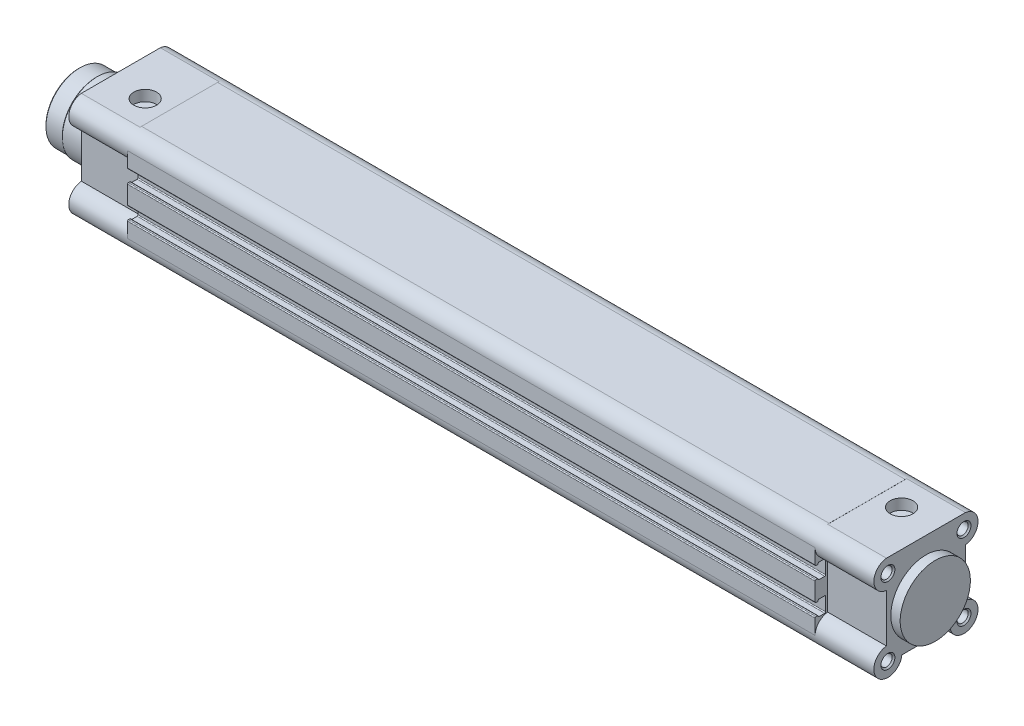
from build123d import *

# Parameters (mm, degrees)
BASIS_LINEAR_AUSTRAGEN_DEPTH         = 25.1
AUFSATZ_LINEAR_AUSTRAGEN1_DEPTH      = 293.8
AUFSATZ_LINEAR_AUSTRAGEN2_DEPTH      = 25.1
SKIZZE4_R                            = 15
AUFSATZ_LINEAR_AUSTRAGEN3_DEPTH      = 4
SCHNITT_LINEAR_AUSTRAGEN1_DEPTH      = 5
SCHNITT_LINEAR_AUSTRAGEN1_DEPTH_BACK = 5
SKIZZE8_W                            = 4.864
SKIZZE8_H                            = 4.864
SKIZZE9_W                            = 4.864
SKIZZE9_H                            = 4.864
SCHNITT_LINEAR_START                 = -30
SKIZZE18_R                           = 14
SCHNITT_LINEAR_AUSTRAGEN2_DEPTH      = 30
SKIZZE19_R                           = 6
SCHNITT_LINEAR_AUSTRAGEN3_DEPTH      = 100


with BuildPart() as part:
    # Skizze1 → Basis-Linear austragen (new body)
    with BuildSketch(Plane(origin=(0, 0, 0), x_dir=(0, 0, -1), z_dir=(1, 0, 0))):
        with BuildLine():
            Line((-16.875, 10.282640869), (-16.875, -10.282640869))
            ThreePointArc((-16.875, -10.282640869), (-20.496194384, -20.489084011), (-10.283696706, -16.885))
            Line((-10.283696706, -16.885), (10.283696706, -16.885))
            ThreePointArc((10.283696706, -16.885), (20.496194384, -20.489084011), (16.875, -10.282640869))
            Line((16.875, -10.282640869), (16.875, 10.282640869))
            ThreePointArc((16.875, 10.282640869), (22.25, 16.25), (16.875, 22.217359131))
            Line((16.875, 22.217359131), (-16.875, 22.217359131))
            ThreePointArc((-16.875, 22.217359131), (-22.25, 16.25), (-16.875, 10.282640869))
        make_face()
    extrude(amount=BASIS_LINEAR_AUSTRAGEN_DEPTH)

    # Skizze2 → Aufsatz-Linear austragen1 (add)
    with BuildSketch(Plane(origin=(25.1, 0, 0), x_dir=(0, 0, -1), z_dir=(1, 0, 0))):
        with BuildLine():
            Line((-22.25, 3.85), (-22.25, -3.85))
            ThreePointArc((-22.25, -3.85), (-22.132842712, -4.132842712), (-21.85, -4.25))
            Line((-21.85, -4.25), (-21.25, -4.25))
            ThreePointArc((-21.25, -4.25), (-21.037867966, -4.162132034), (-20.95, -3.95))
            Line((-20.95, -3.95), (-20.95, -3.9))
            ThreePointArc((-20.95, -3.9), (-20.862132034, -3.687867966), (-20.65, -3.6))
            Line((-20.65, -3.6), (-18.15, -3.6))
            ThreePointArc((-18.15, -3.6), (-17.867157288, -3.717157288), (-17.75, -4))
            Line((-17.75, -4), (-17.75, -9.7))
            ThreePointArc((-17.75, -9.7), (-17.867157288, -9.982842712), (-18.15, -10.1))
            Line((-18.15, -10.1), (-20.65, -10.1))
            ThreePointArc((-20.65, -10.1), (-20.862132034, -10.012132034), (-20.95, -9.8))
            Line((-20.95, -9.8), (-20.95, -9.75))
            ThreePointArc((-20.95, -9.75), (-21.037867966, -9.537867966), (-21.25, -9.45))
            Line((-21.25, -9.45), (-21.85, -9.45))
            ThreePointArc((-21.85, -9.45), (-22.132842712, -9.567157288), (-22.25, -9.85))
            Line((-22.25, -9.85), (-22.25, -16.25))
            ThreePointArc((-22.25, -16.25), (-20.492640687, -20.492640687), (-16.25, -22.25))
            Line((-16.25, -22.25), (-9.85, -22.25))
            ThreePointArc((-9.85, -22.25), (-9.567157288, -22.132842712), (-9.45, -21.85))
            Line((-9.45, -21.85), (-9.45, -21.25))
            ThreePointArc((-9.45, -21.25), (-9.537867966, -21.037867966), (-9.75, -20.95))
            Line((-9.75, -20.95), (-9.8, -20.95))
            ThreePointArc((-9.8, -20.95), (-10.012132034, -20.862132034), (-10.1, -20.65))
            Line((-10.1, -20.65), (-10.1, -18.15))
            ThreePointArc((-10.1, -18.15), (-9.982842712, -17.867157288), (-9.7, -17.75))
            Line((-9.7, -17.75), (-4, -17.75))
            ThreePointArc((-4, -17.75), (-3.717157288, -17.867157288), (-3.6, -18.15))
            Line((-3.6, -18.15), (-3.6, -20.65))
            ThreePointArc((-3.6, -20.65), (-3.687867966, -20.862132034), (-3.9, -20.95))
            Line((-3.9, -20.95), (-3.95, -20.95))
            ThreePointArc((-3.95, -20.95), (-4.162132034, -21.037867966), (-4.25, -21.25))
            Line((-4.25, -21.25), (-4.25, -21.85))
            ThreePointArc((-4.25, -21.85), (-4.132842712, -22.132842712), (-3.85, -22.25))
            Line((-3.85, -22.25), (3.85, -22.25))
            ThreePointArc((3.85, -22.25), (4.132842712, -22.132842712), (4.25, -21.85))
            Line((4.25, -21.85), (4.25, -21.25))
            ThreePointArc((4.25, -21.25), (4.162132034, -21.037867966), (3.95, -20.95))
            Line((3.95, -20.95), (3.9, -20.95))
            ThreePointArc((3.9, -20.95), (3.687867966, -20.862132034), (3.6, -20.65))
            Line((3.6, -20.65), (3.6, -18.15))
            ThreePointArc((3.6, -18.15), (3.717157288, -17.867157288), (4, -17.75))
            Line((4, -17.75), (9.7, -17.75))
            ThreePointArc((9.7, -17.75), (9.982842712, -17.867157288), (10.1, -18.15))
            Line((10.1, -18.15), (10.1, -20.65))
            ThreePointArc((10.1, -20.65), (10.012132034, -20.862132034), (9.8, -20.95))
            Line((9.8, -20.95), (9.75, -20.95))
            ThreePointArc((9.75, -20.95), (9.537867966, -21.037867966), (9.45, -21.25))
            Line((9.45, -21.25), (9.45, -21.85))
            ThreePointArc((9.45, -21.85), (9.567157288, -22.132842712), (9.85, -22.25))
            Line((9.85, -22.25), (16.25, -22.25))
            ThreePointArc((16.25, -22.25), (20.492640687, -20.492640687), (22.25, -16.25))
            Line((22.25, -16.25), (22.25, -9.85))
            ThreePointArc((22.25, -9.85), (22.132842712, -9.567157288), (21.85, -9.45))
            Line((21.85, -9.45), (21.25, -9.45))
            ThreePointArc((21.25, -9.45), (21.037867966, -9.537867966), (20.95, -9.75))
            Line((20.95, -9.75), (20.95, -9.8))
            ThreePointArc((20.95, -9.8), (20.862132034, -10.012132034), (20.65, -10.1))
            Line((20.65, -10.1), (18.15, -10.1))
            ThreePointArc((18.15, -10.1), (17.867157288, -9.982842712), (17.75, -9.7))
            Line((17.75, -9.7), (17.75, -4))
            ThreePointArc((17.75, -4), (17.867157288, -3.717157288), (18.15, -3.6))
            Line((18.15, -3.6), (20.65, -3.6))
            ThreePointArc((20.65, -3.6), (20.862132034, -3.687867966), (20.95, -3.9))
            Line((20.95, -3.9), (20.95, -3.95))
            ThreePointArc((20.95, -3.95), (21.037867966, -4.162132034), (21.25, -4.25))
            Line((21.25, -4.25), (21.85, -4.25))
            ThreePointArc((21.85, -4.25), (22.132842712, -4.132842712), (22.25, -3.85))
            Line((22.25, -3.85), (22.25, 3.85))
            ThreePointArc((22.25, 3.85), (22.132842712, 4.132842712), (21.85, 4.25))
            Line((21.85, 4.25), (21.25, 4.25))
            ThreePointArc((21.25, 4.25), (21.037867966, 4.162132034), (20.95, 3.95))
            Line((20.95, 3.95), (20.95, 3.9))
            ThreePointArc((20.95, 3.9), (20.862132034, 3.687867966), (20.65, 3.6))
            Line((20.65, 3.6), (18.15, 3.6))
            ThreePointArc((18.15, 3.6), (17.867157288, 3.717157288), (17.75, 4))
            Line((17.75, 4), (17.75, 9.7))
            ThreePointArc((17.75, 9.7), (17.867157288, 9.982842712), (18.15, 10.1))
            Line((18.15, 10.1), (20.65, 10.1))
            ThreePointArc((20.65, 10.1), (20.862132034, 10.012132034), (20.95, 9.8))
            Line((20.95, 9.8), (20.95, 9.75))
            ThreePointArc((20.95, 9.75), (21.037867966, 9.537867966), (21.25, 9.45))
            Line((21.25, 9.45), (21.85, 9.45))
            ThreePointArc((21.85, 9.45), (22.132842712, 9.567157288), (22.25, 9.85))
            Line((22.25, 9.85), (22.25, 16.25))
            ThreePointArc((22.25, 16.25), (20.492640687, 20.492640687), (16.25, 22.25))
            Line((16.25, 22.25), (-16.25, 22.25))
            ThreePointArc((-16.25, 22.25), (-20.492640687, 20.492640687), (-22.25, 16.25))
            Line((-22.25, 16.25), (-22.25, 9.85))
            ThreePointArc((-22.25, 9.85), (-22.132842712, 9.567157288), (-21.85, 9.45))
            Line((-21.85, 9.45), (-21.25, 9.45))
            ThreePointArc((-21.25, 9.45), (-21.037867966, 9.537867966), (-20.95, 9.75))
            Line((-20.95, 9.75), (-20.95, 9.8))
            ThreePointArc((-20.95, 9.8), (-20.862132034, 10.012132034), (-20.65, 10.1))
            Line((-20.65, 10.1), (-18.15, 10.1))
            ThreePointArc((-18.15, 10.1), (-17.867157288, 9.982842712), (-17.75, 9.7))
            Line((-17.75, 9.7), (-17.75, 4))
            ThreePointArc((-17.75, 4), (-17.867157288, 3.717157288), (-18.15, 3.6))
            Line((-18.15, 3.6), (-20.65, 3.6))
            ThreePointArc((-20.65, 3.6), (-20.862132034, 3.687867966), (-20.95, 3.9))
            Line((-20.95, 3.9), (-20.95, 3.95))
            ThreePointArc((-20.95, 3.95), (-21.037867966, 4.162132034), (-21.25, 4.25))
            Line((-21.25, 4.25), (-21.85, 4.25))
            ThreePointArc((-21.85, 4.25), (-22.132842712, 4.132842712), (-22.25, 3.85))
        make_face()
    extrude(amount=AUFSATZ_LINEAR_AUSTRAGEN1_DEPTH)

    # Skizze3 → Aufsatz-Linear austragen2 (add)
    with BuildSketch(Plane(origin=(318.9, 0, 0), x_dir=(0, 0, -1), z_dir=(1, 0, 0))):
        with BuildLine():
            Line((-16.875, 10.282640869), (-16.875, -10.282640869))
            ThreePointArc((-16.875, -10.282640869), (-20.496194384, -20.489084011), (-10.283696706, -16.885))
            Line((-10.283696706, -16.885), (10.283696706, -16.885))
            ThreePointArc((10.283696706, -16.885), (20.496194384, -20.489084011), (16.875, -10.282640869))
            Line((16.875, -10.282640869), (16.875, 10.282640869))
            ThreePointArc((16.875, 10.282640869), (22.25, 16.25), (16.875, 22.217359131))
            Line((16.875, 22.217359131), (-16.875, 22.217359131))
            ThreePointArc((-16.875, 22.217359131), (-22.25, 16.25), (-16.875, 10.282640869))
        make_face()
    extrude(amount=AUFSATZ_LINEAR_AUSTRAGEN2_DEPTH)

    # Skizze4 → Aufsatz-Linear austragen3 (add)
    with BuildSketch(Plane(origin=(344, 0, 0), x_dir=(0, 0, -1), z_dir=(1, 0, 0))):
        Circle(SKIZZE4_R)
    extrude(amount=AUFSATZ_LINEAR_AUSTRAGEN3_DEPTH)

    # Skizze5 → Aufsatz-Rotationsk_rper1 (revolve)
    with BuildSketch(Plane.XY, mode=Mode.PRIVATE) as aufsatz_rotationsk_rper1_sk:
        Polygon((-26, 0), (-26, 6), (-18, 6), (-18, 14), (-17.5, 14.5), (-10.5, 14.5), (-10, 15), (0, 15), (0, 0), align=None)
    revolve(aufsatz_rotationsk_rper1_sk.sketch.rotate(Axis((0, 0, 0), (-1, 0, 0)), 90), axis=Axis((0, 0, 0), (-1, 0, 0)))

    # Skizze6 → Schnitt-Linear austragen1 (cut, two sides: drawn at the far end of the back side and taken through both)
    with BuildSketch(Plane.ZY.offset(26).offset(-SCHNITT_LINEAR_AUSTRAGEN1_DEPTH_BACK)):
        Polygon((-5, -30), (-5, 30), (5, 30), (5, -30), (35, -30), (35, 60), (-35, 60), (-35, -30), align=None)
    extrude(amount=SCHNITT_LINEAR_AUSTRAGEN1_DEPTH + SCHNITT_LINEAR_AUSTRAGEN1_DEPTH_BACK, mode=Mode.SUBTRACT)

    # Skizze7 → Aufsatz-Rotationsk_rper2 (revolve)
    with BuildSketch(Plane.XY):
        Polygon((-48, 0), (-48, 4), (-47, 5), (-26, 5), (-26, 0), align=None)
    revolve(axis=Axis((-26, 0, 0), (-1, 0, 0)))

    # Skizze8 → Schnitt-Rotation1 (revolve, cut)
    with BuildSketch(Plane(origin=(15.6, 0, 0), x_dir=(0, 0, -1), z_dir=(1, 0, 0))):
        with Locations((-2.768, 20.068)):
            Rectangle(SKIZZE8_W, SKIZZE8_H)
    revolve(axis=Axis((15.6, 17.636, 5.2), (0, 1, 0)), mode=Mode.SUBTRACT)

    # Skizze9 → Schnitt-Rotation2 (revolve, cut)
    with BuildSketch(Plane(origin=(328.4, 0, 0), x_dir=(0, 0, -1), z_dir=(1, 0, 0))):
        with Locations((7.632, 20.068)):
            Rectangle(SKIZZE9_W, SKIZZE9_H)
    revolve(axis=Axis((328.4, 17.636, -5.2), (0, 1, 0)), mode=Mode.SUBTRACT)

    # Skizze10 → Schnitt-Rotation3 (revolve, cut)
    with BuildSketch(Plane.XY.offset(16.25), mode=Mode.PRIVATE) as schnitt_rotation3_sk:
        Polygon((324.01, 16.25), (325.395640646, 18.65), (343.41, 18.65), (344.01, 19.25), (344.01, 16.25), align=None)
    revolve(schnitt_rotation3_sk.sketch.rotate(Axis((344.01, 16.25, 16.25), (-1, 0, 0)), 90), axis=Axis((344.01, 16.25, 16.25), (-1, 0, 0)), mode=Mode.SUBTRACT)

    # Skizze11 → Schnitt-Rotation4 (revolve, cut)
    with BuildSketch(Plane.XY.offset(16.25), mode=Mode.PRIVATE) as schnitt_rotation4_sk:
        Polygon((324.01, -16.25), (325.395640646, -13.85), (343.41, -13.85), (344.01, -13.25), (344.01, -16.25), align=None)
    revolve(schnitt_rotation4_sk.sketch.rotate(Axis((344.01, -16.25, 16.25), (-1, 0, 0)), 90), axis=Axis((344.01, -16.25, 16.25), (-1, 0, 0)), mode=Mode.SUBTRACT)

    # Skizze12 → Schnitt-Rotation5 (revolve, cut)
    with BuildSketch(Plane.XY.offset(-16.25), mode=Mode.PRIVATE) as schnitt_rotation5_sk:
        Polygon((324.01, 16.25), (325.395640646, 18.65), (343.41, 18.65), (344.01, 19.25), (344.01, 16.25), align=None)
    revolve(schnitt_rotation5_sk.sketch.rotate(Axis((344.01, 16.25, -16.25), (-1, 0, 0)), 90), axis=Axis((344.01, 16.25, -16.25), (-1, 0, 0)), mode=Mode.SUBTRACT)

    # Skizze13 → Schnitt-Rotation6 (revolve, cut)
    with BuildSketch(Plane.XY.offset(-16.25), mode=Mode.PRIVATE) as schnitt_rotation6_sk:
        Polygon((324.01, -16.25), (325.395640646, -13.85), (343.41, -13.85), (344.01, -13.25), (344.01, -16.25), align=None)
    revolve(schnitt_rotation6_sk.sketch.rotate(Axis((344.01, -16.25, -16.25), (-1, 0, 0)), 90), axis=Axis((344.01, -16.25, -16.25), (-1, 0, 0)), mode=Mode.SUBTRACT)

    # Skizze14 → Schnitt-Rotation7 (revolve, cut)
    with BuildSketch(Plane.XY.offset(16.25), mode=Mode.PRIVATE) as schnitt_rotation7_sk:
        Polygon((-0.01, 16.25), (-0.01, 19.25), (0.59, 18.65), (18.604359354, 18.65), (19.99, 16.25), align=None)
    revolve(schnitt_rotation7_sk.sketch.rotate(Axis((19.99, 16.25, 16.25), (-1, 0, 0)), 90), axis=Axis((19.99, 16.25, 16.25), (-1, 0, 0)), mode=Mode.SUBTRACT)

    # Skizze15 → Schnitt-Rotation8 (revolve, cut)
    with BuildSketch(Plane.XY.offset(16.25), mode=Mode.PRIVATE) as schnitt_rotation8_sk:
        Polygon((-0.01, -16.25), (-0.01, -13.25), (0.59, -13.85), (18.604359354, -13.85), (19.99, -16.25), align=None)
    revolve(schnitt_rotation8_sk.sketch.rotate(Axis((19.99, -16.25, 16.25), (-1, 0, 0)), 90), axis=Axis((19.99, -16.25, 16.25), (-1, 0, 0)), mode=Mode.SUBTRACT)

    # Skizze16 → Schnitt-Rotation9 (revolve, cut)
    with BuildSketch(Plane.XY.offset(-16.25), mode=Mode.PRIVATE) as schnitt_rotation9_sk:
        Polygon((-0.01, 16.25), (-0.01, 19.25), (0.59, 18.65), (18.604359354, 18.65), (19.99, 16.25), align=None)
    revolve(schnitt_rotation9_sk.sketch.rotate(Axis((19.99, 16.25, -16.25), (-1, 0, 0)), 90), axis=Axis((19.99, 16.25, -16.25), (-1, 0, 0)), mode=Mode.SUBTRACT)

    # Skizze17 → Schnitt-Rotation10 (revolve, cut)
    with BuildSketch(Plane.XY.offset(-16.25), mode=Mode.PRIVATE) as schnitt_rotation10_sk:
        Polygon((-0.01, -16.25), (-0.01, -13.25), (0.59, -13.85), (18.604359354, -13.85), (19.99, -16.25), align=None)
    revolve(schnitt_rotation10_sk.sketch.rotate(Axis((19.99, -16.25, -16.25), (-1, 0, 0)), 90), axis=Axis((19.99, -16.25, -16.25), (-1, 0, 0)), mode=Mode.SUBTRACT)

    # Skizze18 → Schnitt-Linear austragen2 (cut)
    with BuildSketch(Plane.ZY.offset(48).offset(SCHNITT_LINEAR_START)):
        Circle(SKIZZE18_R)
    extrude(amount=SCHNITT_LINEAR_AUSTRAGEN2_DEPTH, mode=Mode.SUBTRACT)

    # Skizze19 → Schnitt-Linear austragen3 (cut)
    with BuildSketch(Plane.ZY.offset(18)):
        Circle(SKIZZE19_R)
    extrude(amount=-SCHNITT_LINEAR_AUSTRAGEN3_DEPTH, mode=Mode.SUBTRACT)


solid = part.part
